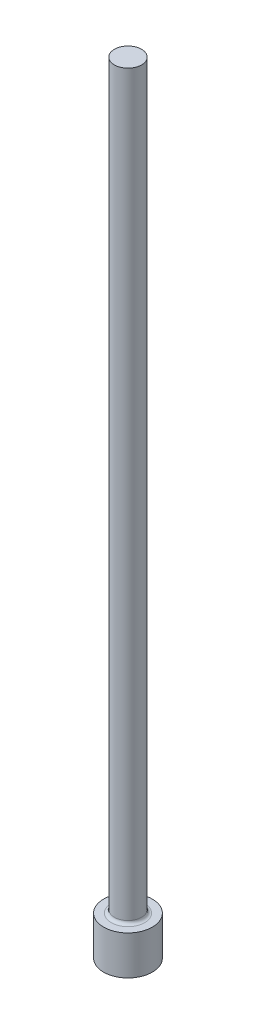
ISO-10303-21;
HEADER;
FILE_DESCRIPTION(('STEP AP214'),'2;1');
FILE_NAME('part.step','',(''),(''),'','','');
FILE_SCHEMA(('AUTOMOTIVE_DESIGN { 1 0 10303 214 1 1 1 1 }'));
ENDSEC;
DATA;
#1=APPLICATION_CONTEXT('core data for automotive mechanical design processes');
#2=APPLICATION_PROTOCOL_DEFINITION('international standard','automotive_design',2000,#1);
#3=PRODUCT_CONTEXT('',#1,'mechanical');
#4=PRODUCT('Part','Part','',(#3));
#5=PRODUCT_RELATED_PRODUCT_CATEGORY('part','',(#4));
#6=PRODUCT_DEFINITION_FORMATION('','',#4);
#7=PRODUCT_DEFINITION_CONTEXT('part definition',#1,'design');
#8=PRODUCT_DEFINITION('design','',#6,#7);
#9=PRODUCT_DEFINITION_SHAPE('','',#8);
#10=(LENGTH_UNIT() NAMED_UNIT(*) SI_UNIT(.MILLI.,.METRE.));
#11=(NAMED_UNIT(*) PLANE_ANGLE_UNIT() SI_UNIT($,.RADIAN.));
#12=(NAMED_UNIT(*) SI_UNIT($,.STERADIAN.) SOLID_ANGLE_UNIT());
#13=UNCERTAINTY_MEASURE_WITH_UNIT(LENGTH_MEASURE(1.E-05),#10,'distance_accuracy_value','');
#14=(GEOMETRIC_REPRESENTATION_CONTEXT(3) GLOBAL_UNCERTAINTY_ASSIGNED_CONTEXT((#13)) GLOBAL_UNIT_ASSIGNED_CONTEXT((#10,
#11,#12)) REPRESENTATION_CONTEXT('',''));
#15=CARTESIAN_POINT('',(0.,0.,0.));
#16=DIRECTION('',(0.,0.,1.));
#17=DIRECTION('',(1.,0.,0.));
#18=AXIS2_PLACEMENT_3D('',#15,#16,#17);
#19=CARTESIAN_POINT('',(0.,63.5,0.));
#20=DIRECTION('',(0.,-1.,0.));
#21=DIRECTION('',(0.,0.,-1.));
#22=AXIS2_PLACEMENT_3D('',#19,#20,#21);
#23=PLANE('',#22);
#24=CARTESIAN_POINT('',(0.,63.5,0.));
#25=DIRECTION('',(0.,1.,0.));
#26=DIRECTION('',(0.,0.,1.));
#27=AXIS2_PLACEMENT_3D('',#24,#25,#26);
#28=CIRCLE('',#27,1.1049);
#29=CARTESIAN_POINT('',(0.,63.5,1.1049));
#30=VERTEX_POINT('',#29);
#31=EDGE_CURVE('E10',#30,#30,#28,.T.);
#32=ORIENTED_EDGE('',*,*,#31,.T.);
#33=EDGE_LOOP('',(#32));
#34=FACE_BOUND('',#33,.T.);
#35=ADVANCED_FACE('F30',(#34),#23,.F.);
#36=CARTESIAN_POINT('',(0.,0.,0.));
#37=DIRECTION('',(0.,1.,0.));
#38=DIRECTION('',(0.,0.,1.));
#39=AXIS2_PLACEMENT_3D('',#36,#37,#38);
#40=CYLINDRICAL_SURFACE('',#39,1.1049);
#41=ORIENTED_EDGE('',*,*,#31,.F.);
#42=EDGE_LOOP('',(#41));
#43=FACE_BOUND('',#42,.T.);
#44=CARTESIAN_POINT('',(0.,3.429,0.));
#45=DIRECTION('',(0.,1.,0.));
#46=DIRECTION('',(0.,0.,1.));
#47=AXIS2_PLACEMENT_3D('',#44,#45,#46);
#48=CIRCLE('',#47,1.1049);
#49=CARTESIAN_POINT('',(0.,3.429,1.1049));
#50=VERTEX_POINT('',#49);
#51=EDGE_CURVE('E36',#50,#50,#48,.T.);
#52=ORIENTED_EDGE('',*,*,#51,.T.);
#53=EDGE_LOOP('',(#52));
#54=FACE_BOUND('',#53,.T.);
#55=ADVANCED_FACE('F65',(#43,#54),#40,.T.);
#56=CARTESIAN_POINT('',(0.,3.429,0.));
#57=DIRECTION('',(0.,1.,0.));
#58=DIRECTION('',(0.,0.,1.));
#59=AXIS2_PLACEMENT_3D('',#56,#57,#58);
#60=TOROIDAL_SURFACE('',#59,1.3589,0.254);
#61=ORIENTED_EDGE('',*,*,#51,.F.);
#62=EDGE_LOOP('',(#61));
#63=FACE_BOUND('',#62,.T.);
#64=CARTESIAN_POINT('',(0.,3.175,0.));
#65=DIRECTION('',(0.,1.,0.));
#66=DIRECTION('',(0.,0.,1.));
#67=AXIS2_PLACEMENT_3D('',#64,#65,#66);
#68=CIRCLE('',#67,1.3589);
#69=CARTESIAN_POINT('',(0.,3.175,1.3589));
#70=VERTEX_POINT('',#69);
#71=EDGE_CURVE('E40',#70,#70,#68,.T.);
#72=ORIENTED_EDGE('',*,*,#71,.T.);
#73=EDGE_LOOP('',(#72));
#74=FACE_BOUND('',#73,.T.);
#75=ADVANCED_FACE('F69',(#63,#74),#60,.F.);
#76=CARTESIAN_POINT('',(1.9812,3.175,0.));
#77=DIRECTION('',(0.,-1.,0.));
#78=DIRECTION('',(0.,0.,-1.));
#79=AXIS2_PLACEMENT_3D('',#76,#77,#78);
#80=PLANE('',#79);
#81=ORIENTED_EDGE('',*,*,#71,.F.);
#82=EDGE_LOOP('',(#81));
#83=FACE_BOUND('',#82,.T.);
#84=CARTESIAN_POINT('',(0.,3.175,0.));
#85=DIRECTION('',(0.,1.,0.));
#86=DIRECTION('',(0.,0.,1.));
#87=AXIS2_PLACEMENT_3D('',#84,#85,#86);
#88=CIRCLE('',#87,1.9812);
#89=CARTESIAN_POINT('',(0.,3.175,1.9812));
#90=VERTEX_POINT('',#89);
#91=EDGE_CURVE('E44',#90,#90,#88,.T.);
#92=ORIENTED_EDGE('',*,*,#91,.T.);
#93=EDGE_LOOP('',(#92));
#94=FACE_BOUND('',#93,.T.);
#95=ADVANCED_FACE('F61',(#83,#94),#80,.F.);
#96=CARTESIAN_POINT('',(0.,0.,0.));
#97=DIRECTION('',(0.,1.,0.));
#98=DIRECTION('',(0.,0.,1.));
#99=AXIS2_PLACEMENT_3D('',#96,#97,#98);
#100=CYLINDRICAL_SURFACE('',#99,1.9812);
#101=ORIENTED_EDGE('',*,*,#91,.F.);
#102=EDGE_LOOP('',(#101));
#103=FACE_BOUND('',#102,.T.);
#104=CARTESIAN_POINT('',(0.,0.,0.));
#105=DIRECTION('',(0.,1.,0.));
#106=DIRECTION('',(0.,0.,1.));
#107=AXIS2_PLACEMENT_3D('',#104,#105,#106);
#108=CIRCLE('',#107,1.9812);
#109=CARTESIAN_POINT('',(0.,0.,1.9812));
#110=VERTEX_POINT('',#109);
#111=EDGE_CURVE('E49',#110,#110,#108,.T.);
#112=ORIENTED_EDGE('',*,*,#111,.T.);
#113=EDGE_LOOP('',(#112));
#114=FACE_BOUND('',#113,.T.);
#115=ADVANCED_FACE('F53',(#103,#114),#100,.T.);
#116=CARTESIAN_POINT('',(0.,0.,0.));
#117=DIRECTION('',(0.,1.,0.));
#118=DIRECTION('',(0.,0.,1.));
#119=AXIS2_PLACEMENT_3D('',#116,#117,#118);
#120=PLANE('',#119);
#121=ORIENTED_EDGE('',*,*,#111,.F.);
#122=EDGE_LOOP('',(#121));
#123=FACE_BOUND('',#122,.T.);
#124=ADVANCED_FACE('F55',(#123),#120,.F.);
#125=CLOSED_SHELL('',(#35,#55,#75,#95,#115,#124));
#126=MANIFOLD_SOLID_BREP('B2',#125);
#127=ADVANCED_BREP_SHAPE_REPRESENTATION('',(#18,#126),#14);
#128=SHAPE_DEFINITION_REPRESENTATION(#9,#127);
ENDSEC;
END-ISO-10303-21;
